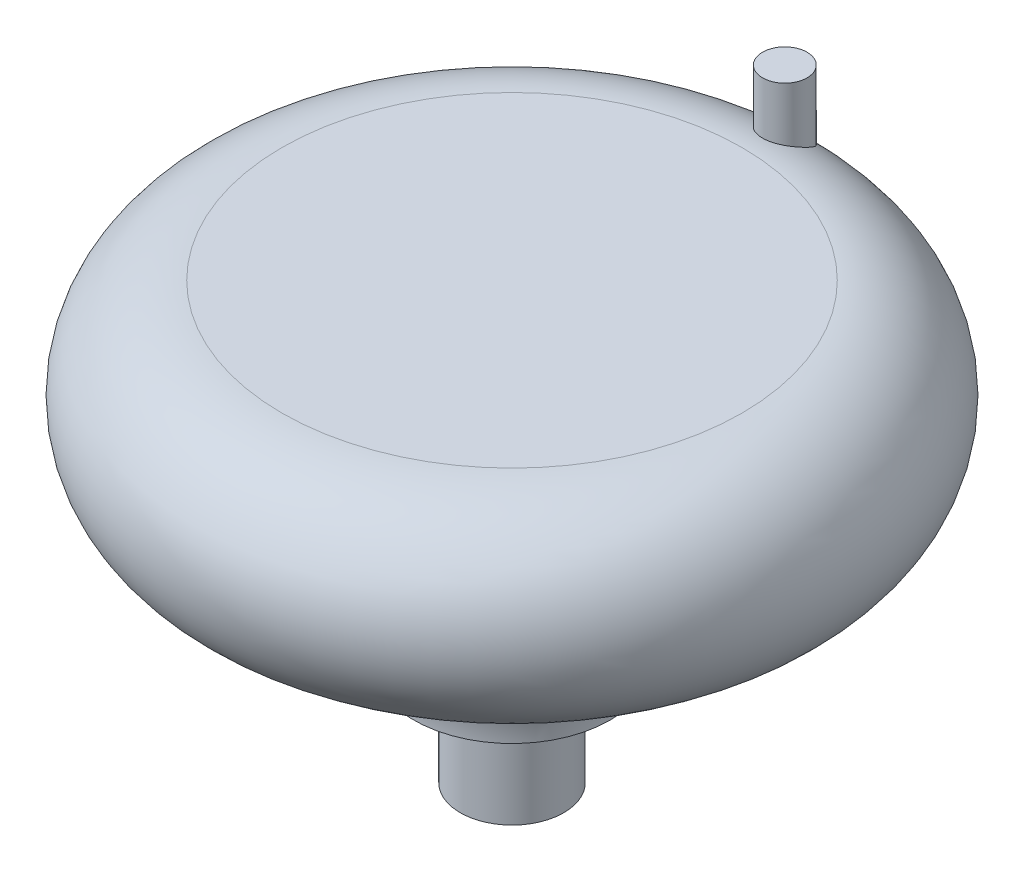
from build123d import *

# Parameters (mm, degrees)
SKIZZE2_R               = 2.5
LINEAR_AUSTRAGEN1_DEPTH = 5
SKIZZE3_W               = 3.708710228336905
SKIZZE3_H               = 1.0736530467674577


with BuildPart() as part:
    # Skizze1 → Rotation1 (revolve)
    with BuildSketch(Plane.XY):
        with BuildLine():
            Line((11.099803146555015, 22.350000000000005), (-1e-17, 22.349999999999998))
            Line((-1e-17, 22.349999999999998), (0, 6.35))
            Line((0, 6.35), (4.75, 6.35))
            ThreePointArc((4.75, 6.35), (6.592032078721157, 10.872415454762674), (11.099803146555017, 12.750000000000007))
            ThreePointArc((11.099803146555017, 12.750000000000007), (15.899803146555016, 17.550000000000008), (11.099803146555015, 22.350000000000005))
        make_face()
    revolve(axis=Axis((-1e-17, 22.349999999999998, 0), (0, -1, 0)))

    # Skizze2 → Linear austragen1 (add)
    with BuildSketch(Plane.XZ.offset(-6.35)):
        with Locations(Location((0, 0, 0), (0, 0, 270))):
            Circle(SKIZZE2_R)
    extrude(amount=LINEAR_AUSTRAGEN1_DEPTH)

    # Skizze3 → Rotation2 (revolve)
    with BuildSketch(Plane(origin=(5.79033439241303, -4e-17, -3.4523873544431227), x_dir=(1e-17, 1, 0), z_dir=(0.8589171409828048, 0, -0.5121145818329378)), mode=Mode.PRIVATE) as rotation2_sk:
        with Locations((22.910644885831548, -11.843543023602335)):
            Rectangle(SKIZZE3_W, SKIZZE3_H)
    revolve(rotation2_sk.sketch.rotate(Axis((0, 24.765000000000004, -13.163919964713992), (0, -1, 0)), 30.804783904), axis=Axis((0, 24.765000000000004, -13.163919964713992), (0, -1, 0)))


solid = part.part
